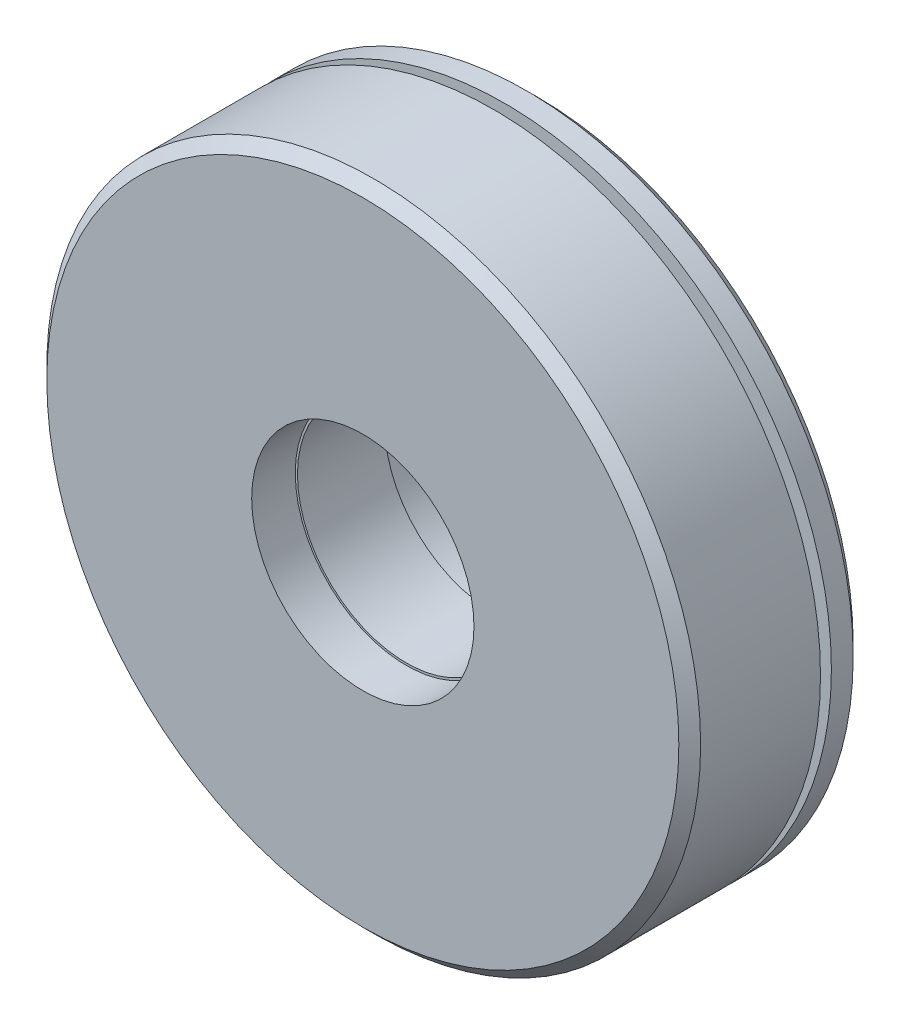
ISO-10303-21;
HEADER;
FILE_DESCRIPTION(('STEP AP214'),'2;1');
FILE_NAME('part.step','',(''),(''),'','','');
FILE_SCHEMA(('AUTOMOTIVE_DESIGN { 1 0 10303 214 1 1 1 1 }'));
ENDSEC;
DATA;
#1=APPLICATION_CONTEXT('core data for automotive mechanical design processes');
#2=APPLICATION_PROTOCOL_DEFINITION('international standard','automotive_design',2000,#1);
#3=PRODUCT_CONTEXT('',#1,'mechanical');
#4=PRODUCT('Part','Part','',(#3));
#5=PRODUCT_RELATED_PRODUCT_CATEGORY('part','',(#4));
#6=PRODUCT_DEFINITION_FORMATION('','',#4);
#7=PRODUCT_DEFINITION_CONTEXT('part definition',#1,'design');
#8=PRODUCT_DEFINITION('design','',#6,#7);
#9=PRODUCT_DEFINITION_SHAPE('','',#8);
#10=(LENGTH_UNIT() NAMED_UNIT(*) SI_UNIT(.MILLI.,.METRE.));
#11=(NAMED_UNIT(*) PLANE_ANGLE_UNIT() SI_UNIT($,.RADIAN.));
#12=(NAMED_UNIT(*) SI_UNIT($,.STERADIAN.) SOLID_ANGLE_UNIT());
#13=UNCERTAINTY_MEASURE_WITH_UNIT(LENGTH_MEASURE(1.E-05),#10,'distance_accuracy_value','');
#14=(GEOMETRIC_REPRESENTATION_CONTEXT(3) GLOBAL_UNCERTAINTY_ASSIGNED_CONTEXT((#13)) GLOBAL_UNIT_ASSIGNED_CONTEXT((#10,
#11,#12)) REPRESENTATION_CONTEXT('',''));
#15=CARTESIAN_POINT('',(0.,0.,0.));
#16=DIRECTION('',(0.,0.,1.));
#17=DIRECTION('',(1.,0.,0.));
#18=AXIS2_PLACEMENT_3D('',#15,#16,#17);
#19=CARTESIAN_POINT('',(0.,0.,7.5));
#20=DIRECTION('',(0.,0.,-1.));
#21=DIRECTION('',(-1.,0.,0.));
#22=AXIS2_PLACEMENT_3D('',#19,#20,#21);
#23=CONICAL_SURFACE('',#22,15.,0.785398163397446);
#24=CARTESIAN_POINT('',(0.,0.,8.));
#25=DIRECTION('',(0.,0.,1.));
#26=DIRECTION('',(1.,0.,0.));
#27=AXIS2_PLACEMENT_3D('',#24,#25,#26);
#28=CIRCLE('',#27,14.5);
#29=CARTESIAN_POINT('',(14.5,0.,8.));
#30=VERTEX_POINT('',#29);
#31=EDGE_CURVE('E8',#30,#30,#28,.T.);
#32=ORIENTED_EDGE('',*,*,#31,.F.);
#33=EDGE_LOOP('',(#32));
#34=FACE_BOUND('',#33,.T.);
#35=CARTESIAN_POINT('',(0.,0.,7.5));
#36=DIRECTION('',(0.,0.,1.));
#37=DIRECTION('',(1.,0.,0.));
#38=AXIS2_PLACEMENT_3D('',#35,#36,#37);
#39=CIRCLE('',#38,15.);
#40=CARTESIAN_POINT('',(15.,0.,7.5));
#41=VERTEX_POINT('',#40);
#42=EDGE_CURVE('E59',#41,#41,#39,.T.);
#43=ORIENTED_EDGE('',*,*,#42,.T.);
#44=EDGE_LOOP('',(#43));
#45=FACE_BOUND('',#44,.T.);
#46=ADVANCED_FACE('F13',(#34,#45),#23,.T.);
#47=CARTESIAN_POINT('',(0.,14.5,8.));
#48=DIRECTION('',(0.,0.,-1.));
#49=DIRECTION('',(-1.,0.,0.));
#50=AXIS2_PLACEMENT_3D('',#47,#48,#49);
#51=PLANE('',#50);
#52=CARTESIAN_POINT('',(0.,0.,8.));
#53=DIRECTION('',(0.,0.,1.));
#54=DIRECTION('',(1.,0.,0.));
#55=AXIS2_PLACEMENT_3D('',#52,#53,#54);
#56=CIRCLE('',#55,5.1);
#57=CARTESIAN_POINT('',(5.1,0.,8.));
#58=VERTEX_POINT('',#57);
#59=EDGE_CURVE('E19',#58,#58,#56,.T.);
#60=ORIENTED_EDGE('',*,*,#59,.F.);
#61=EDGE_LOOP('',(#60));
#62=FACE_BOUND('',#61,.T.);
#63=ORIENTED_EDGE('',*,*,#31,.T.);
#64=EDGE_LOOP('',(#63));
#65=FACE_BOUND('',#64,.T.);
#66=ADVANCED_FACE('F132',(#62,#65),#51,.F.);
#67=CARTESIAN_POINT('',(0.,0.,0.));
#68=DIRECTION('',(0.,0.,1.));
#69=DIRECTION('',(1.,0.,0.));
#70=AXIS2_PLACEMENT_3D('',#67,#68,#69);
#71=CYLINDRICAL_SURFACE('',#70,5.1);
#72=CARTESIAN_POINT('',(0.,0.,6.));
#73=DIRECTION('',(0.,0.,1.));
#74=DIRECTION('',(1.,0.,0.));
#75=AXIS2_PLACEMENT_3D('',#72,#73,#74);
#76=CIRCLE('',#75,5.1);
#77=CARTESIAN_POINT('',(5.1,0.,6.));
#78=VERTEX_POINT('',#77);
#79=EDGE_CURVE('E23',#78,#78,#76,.T.);
#80=ORIENTED_EDGE('',*,*,#79,.F.);
#81=EDGE_LOOP('',(#80));
#82=FACE_BOUND('',#81,.T.);
#83=ORIENTED_EDGE('',*,*,#59,.T.);
#84=EDGE_LOOP('',(#83));
#85=FACE_BOUND('',#84,.T.);
#86=ADVANCED_FACE('F127',(#82,#85),#71,.F.);
#87=CARTESIAN_POINT('',(0.,5.1,6.));
#88=DIRECTION('',(0.,0.,-1.));
#89=DIRECTION('',(-1.,0.,0.));
#90=AXIS2_PLACEMENT_3D('',#87,#88,#89);
#91=PLANE('',#90);
#92=CARTESIAN_POINT('',(0.,0.,6.));
#93=DIRECTION('',(0.,0.,1.));
#94=DIRECTION('',(1.,0.,0.));
#95=AXIS2_PLACEMENT_3D('',#92,#93,#94);
#96=CIRCLE('',#95,5.);
#97=CARTESIAN_POINT('',(5.,0.,6.));
#98=VERTEX_POINT('',#97);
#99=EDGE_CURVE('E27',#98,#98,#96,.T.);
#100=ORIENTED_EDGE('',*,*,#99,.F.);
#101=EDGE_LOOP('',(#100));
#102=FACE_BOUND('',#101,.T.);
#103=ORIENTED_EDGE('',*,*,#79,.T.);
#104=EDGE_LOOP('',(#103));
#105=FACE_BOUND('',#104,.T.);
#106=ADVANCED_FACE('F121',(#102,#105),#91,.F.);
#107=CARTESIAN_POINT('',(0.,0.,0.));
#108=DIRECTION('',(0.,0.,1.));
#109=DIRECTION('',(1.,0.,0.));
#110=AXIS2_PLACEMENT_3D('',#107,#108,#109);
#111=CYLINDRICAL_SURFACE('',#110,5.);
#112=CARTESIAN_POINT('',(0.,0.,2.));
#113=DIRECTION('',(0.,0.,1.));
#114=DIRECTION('',(1.,0.,0.));
#115=AXIS2_PLACEMENT_3D('',#112,#113,#114);
#116=CIRCLE('',#115,5.);
#117=CARTESIAN_POINT('',(5.,0.,2.));
#118=VERTEX_POINT('',#117);
#119=EDGE_CURVE('E32',#118,#118,#116,.T.);
#120=ORIENTED_EDGE('',*,*,#119,.F.);
#121=EDGE_LOOP('',(#120));
#122=FACE_BOUND('',#121,.T.);
#123=ORIENTED_EDGE('',*,*,#99,.T.);
#124=EDGE_LOOP('',(#123));
#125=FACE_BOUND('',#124,.T.);
#126=ADVANCED_FACE('F115',(#122,#125),#111,.F.);
#127=CARTESIAN_POINT('',(0.,5.,2.));
#128=DIRECTION('',(0.,0.,1.));
#129=DIRECTION('',(1.,0.,0.));
#130=AXIS2_PLACEMENT_3D('',#127,#128,#129);
#131=PLANE('',#130);
#132=CARTESIAN_POINT('',(0.,0.,2.));
#133=DIRECTION('',(0.,0.,1.));
#134=DIRECTION('',(1.,0.,0.));
#135=AXIS2_PLACEMENT_3D('',#132,#133,#134);
#136=CIRCLE('',#135,5.1);
#137=CARTESIAN_POINT('',(5.1,0.,2.));
#138=VERTEX_POINT('',#137);
#139=EDGE_CURVE('E35',#138,#138,#136,.T.);
#140=ORIENTED_EDGE('',*,*,#139,.F.);
#141=EDGE_LOOP('',(#140));
#142=FACE_BOUND('',#141,.T.);
#143=ORIENTED_EDGE('',*,*,#119,.T.);
#144=EDGE_LOOP('',(#143));
#145=FACE_BOUND('',#144,.T.);
#146=ADVANCED_FACE('F109',(#142,#145),#131,.F.);
#147=CARTESIAN_POINT('',(0.,0.,0.));
#148=DIRECTION('',(0.,0.,1.));
#149=DIRECTION('',(1.,0.,0.));
#150=AXIS2_PLACEMENT_3D('',#147,#148,#149);
#151=CYLINDRICAL_SURFACE('',#150,5.1);
#152=CARTESIAN_POINT('',(0.,0.,0.));
#153=DIRECTION('',(0.,0.,1.));
#154=DIRECTION('',(1.,0.,0.));
#155=AXIS2_PLACEMENT_3D('',#152,#153,#154);
#156=CIRCLE('',#155,5.1);
#157=CARTESIAN_POINT('',(5.1,0.,0.));
#158=VERTEX_POINT('',#157);
#159=EDGE_CURVE('E38',#158,#158,#156,.T.);
#160=ORIENTED_EDGE('',*,*,#159,.F.);
#161=EDGE_LOOP('',(#160));
#162=FACE_BOUND('',#161,.T.);
#163=ORIENTED_EDGE('',*,*,#139,.T.);
#164=EDGE_LOOP('',(#163));
#165=FACE_BOUND('',#164,.T.);
#166=ADVANCED_FACE('F103',(#162,#165),#151,.F.);
#167=CARTESIAN_POINT('',(0.,5.1,0.));
#168=DIRECTION('',(0.,0.,1.));
#169=DIRECTION('',(1.,0.,0.));
#170=AXIS2_PLACEMENT_3D('',#167,#168,#169);
#171=PLANE('',#170);
#172=CARTESIAN_POINT('',(0.,0.,0.));
#173=DIRECTION('',(0.,0.,1.));
#174=DIRECTION('',(1.,0.,0.));
#175=AXIS2_PLACEMENT_3D('',#172,#173,#174);
#176=CIRCLE('',#175,14.5);
#177=CARTESIAN_POINT('',(14.5,0.,0.));
#178=VERTEX_POINT('',#177);
#179=EDGE_CURVE('E41',#178,#178,#176,.T.);
#180=ORIENTED_EDGE('',*,*,#179,.F.);
#181=EDGE_LOOP('',(#180));
#182=FACE_BOUND('',#181,.T.);
#183=ORIENTED_EDGE('',*,*,#159,.T.);
#184=EDGE_LOOP('',(#183));
#185=FACE_BOUND('',#184,.T.);
#186=ADVANCED_FACE('F97',(#182,#185),#171,.F.);
#187=CARTESIAN_POINT('',(0.,0.,0.));
#188=DIRECTION('',(0.,0.,1.));
#189=DIRECTION('',(1.,0.,0.));
#190=AXIS2_PLACEMENT_3D('',#187,#188,#189);
#191=CONICAL_SURFACE('',#190,14.5,0.785398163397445);
#192=CARTESIAN_POINT('',(0.,0.,0.5));
#193=DIRECTION('',(0.,0.,1.));
#194=DIRECTION('',(1.,0.,0.));
#195=AXIS2_PLACEMENT_3D('',#192,#193,#194);
#196=CIRCLE('',#195,15.);
#197=CARTESIAN_POINT('',(15.,0.,0.5));
#198=VERTEX_POINT('',#197);
#199=EDGE_CURVE('E44',#198,#198,#196,.T.);
#200=ORIENTED_EDGE('',*,*,#199,.F.);
#201=EDGE_LOOP('',(#200));
#202=FACE_BOUND('',#201,.T.);
#203=ORIENTED_EDGE('',*,*,#179,.T.);
#204=EDGE_LOOP('',(#203));
#205=FACE_BOUND('',#204,.T.);
#206=ADVANCED_FACE('F91',(#202,#205),#191,.T.);
#207=CARTESIAN_POINT('',(0.,0.,0.));
#208=DIRECTION('',(0.,0.,1.));
#209=DIRECTION('',(1.,0.,0.));
#210=AXIS2_PLACEMENT_3D('',#207,#208,#209);
#211=CYLINDRICAL_SURFACE('',#210,15.);
#212=CARTESIAN_POINT('',(0.,0.,1.5));
#213=DIRECTION('',(0.,0.,1.));
#214=DIRECTION('',(1.,0.,0.));
#215=AXIS2_PLACEMENT_3D('',#212,#213,#214);
#216=CIRCLE('',#215,15.);
#217=CARTESIAN_POINT('',(15.,0.,1.5));
#218=VERTEX_POINT('',#217);
#219=EDGE_CURVE('E47',#218,#218,#216,.T.);
#220=ORIENTED_EDGE('',*,*,#219,.F.);
#221=EDGE_LOOP('',(#220));
#222=FACE_BOUND('',#221,.T.);
#223=ORIENTED_EDGE('',*,*,#199,.T.);
#224=EDGE_LOOP('',(#223));
#225=FACE_BOUND('',#224,.T.);
#226=ADVANCED_FACE('F85',(#222,#225),#211,.T.);
#227=CARTESIAN_POINT('',(0.,15.,1.5));
#228=DIRECTION('',(0.,0.,-1.));
#229=DIRECTION('',(-1.,0.,0.));
#230=AXIS2_PLACEMENT_3D('',#227,#228,#229);
#231=PLANE('',#230);
#232=CARTESIAN_POINT('',(0.,0.,1.5));
#233=DIRECTION('',(0.,0.,1.));
#234=DIRECTION('',(1.,0.,0.));
#235=AXIS2_PLACEMENT_3D('',#232,#233,#234);
#236=CIRCLE('',#235,13.35);
#237=CARTESIAN_POINT('',(13.35,0.,1.5));
#238=VERTEX_POINT('',#237);
#239=EDGE_CURVE('E50',#238,#238,#236,.T.);
#240=ORIENTED_EDGE('',*,*,#239,.F.);
#241=EDGE_LOOP('',(#240));
#242=FACE_BOUND('',#241,.T.);
#243=ORIENTED_EDGE('',*,*,#219,.T.);
#244=EDGE_LOOP('',(#243));
#245=FACE_BOUND('',#244,.T.);
#246=ADVANCED_FACE('F79',(#242,#245),#231,.F.);
#247=CARTESIAN_POINT('',(0.,0.,0.));
#248=DIRECTION('',(0.,0.,1.));
#249=DIRECTION('',(1.,0.,0.));
#250=AXIS2_PLACEMENT_3D('',#247,#248,#249);
#251=CYLINDRICAL_SURFACE('',#250,13.35);
#252=CARTESIAN_POINT('',(0.,0.,2.));
#253=DIRECTION('',(0.,0.,1.));
#254=DIRECTION('',(1.,0.,0.));
#255=AXIS2_PLACEMENT_3D('',#252,#253,#254);
#256=CIRCLE('',#255,13.35);
#257=CARTESIAN_POINT('',(13.35,0.,2.));
#258=VERTEX_POINT('',#257);
#259=EDGE_CURVE('E53',#258,#258,#256,.T.);
#260=ORIENTED_EDGE('',*,*,#259,.F.);
#261=EDGE_LOOP('',(#260));
#262=FACE_BOUND('',#261,.T.);
#263=ORIENTED_EDGE('',*,*,#239,.T.);
#264=EDGE_LOOP('',(#263));
#265=FACE_BOUND('',#264,.T.);
#266=ADVANCED_FACE('F73',(#262,#265),#251,.T.);
#267=CARTESIAN_POINT('',(0.,13.35,2.));
#268=DIRECTION('',(0.,0.,1.));
#269=DIRECTION('',(1.,0.,0.));
#270=AXIS2_PLACEMENT_3D('',#267,#268,#269);
#271=PLANE('',#270);
#272=CARTESIAN_POINT('',(0.,0.,2.));
#273=DIRECTION('',(0.,0.,1.));
#274=DIRECTION('',(1.,0.,0.));
#275=AXIS2_PLACEMENT_3D('',#272,#273,#274);
#276=CIRCLE('',#275,15.);
#277=CARTESIAN_POINT('',(15.,0.,2.));
#278=VERTEX_POINT('',#277);
#279=EDGE_CURVE('E56',#278,#278,#276,.T.);
#280=ORIENTED_EDGE('',*,*,#279,.F.);
#281=EDGE_LOOP('',(#280));
#282=FACE_BOUND('',#281,.T.);
#283=ORIENTED_EDGE('',*,*,#259,.T.);
#284=EDGE_LOOP('',(#283));
#285=FACE_BOUND('',#284,.T.);
#286=ADVANCED_FACE('F67',(#282,#285),#271,.F.);
#287=CARTESIAN_POINT('',(0.,0.,0.));
#288=DIRECTION('',(0.,0.,1.));
#289=DIRECTION('',(1.,0.,0.));
#290=AXIS2_PLACEMENT_3D('',#287,#288,#289);
#291=CYLINDRICAL_SURFACE('',#290,15.);
#292=ORIENTED_EDGE('',*,*,#42,.F.);
#293=EDGE_LOOP('',(#292));
#294=FACE_BOUND('',#293,.T.);
#295=ORIENTED_EDGE('',*,*,#279,.T.);
#296=EDGE_LOOP('',(#295));
#297=FACE_BOUND('',#296,.T.);
#298=ADVANCED_FACE('F64',(#294,#297),#291,.T.);
#299=CLOSED_SHELL('',(#46,#66,#86,#106,#126,#146,#166,#186,#206,#226,#246,#266,#286,#298));
#300=MANIFOLD_SOLID_BREP('B1',#299);
#301=ADVANCED_BREP_SHAPE_REPRESENTATION('',(#18,#300),#14);
#302=SHAPE_DEFINITION_REPRESENTATION(#9,#301);
ENDSEC;
END-ISO-10303-21;
